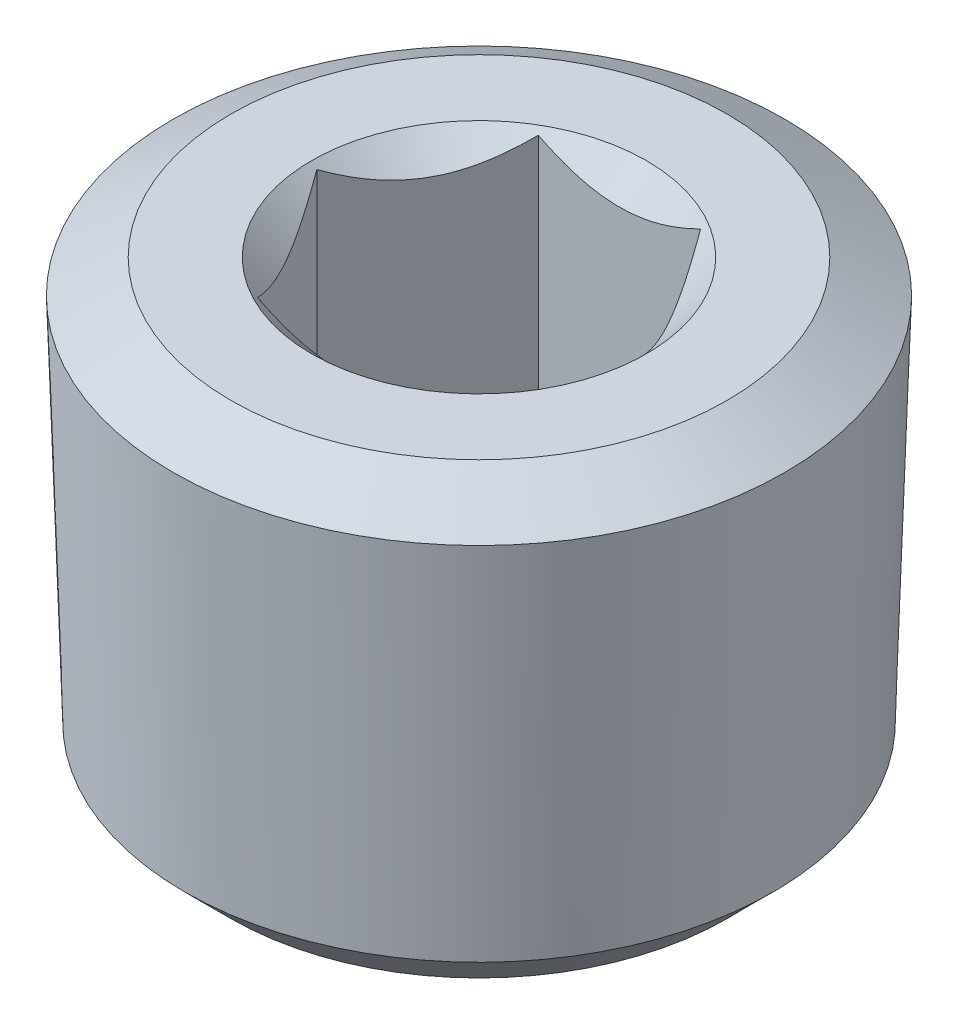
from build123d import *

# Parameters (mm, degrees)
CUT_EXTRUDE1_START = -6.858
CUT_EXTRUDE1_DEPTH = 6.71095


with BuildPart() as part:
    # Sketch2 → Revolve1 (revolve)
    with BuildSketch(Plane.XY, mode=Mode.PRIVATE) as revolve1_sk:
        Polygon((0, 0), (-7.020348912, 0), (-8.657297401, -0.94509265), (-8.331271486, -11.389077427), (-7.020348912, -12.7), (0, -12.7), align=None)
    revolve(revolve1_sk.sketch.rotate(Axis((0, 10.744282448, 0), (0, -1, 0)), 270), axis=Axis((0, 10.744282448, 0), (0, -1, 0)))

    # Sketch3 → Cut-Revolve1 (revolve, cut)
    with BuildSketch(Plane.XY, mode=Mode.PRIVATE) as cut_revolve1_sk:
        Polygon((0, 0), (-4.7371, 0), (-3.9751, -0.762), (-3.9751, -6.858), (-2.706919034, -7.62), (0, -7.62), align=None)
    revolve(cut_revolve1_sk.sketch.rotate(Axis((0, 2.934222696, 0), (0, -1, 0)), 270), axis=Axis((0, 2.934222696, 0), (0, -1, 0)), mode=Mode.SUBTRACT)

    # Sketch4 → Cut-Extrude1 (cut)
    with BuildSketch(Plane(origin=(0, 0, 0), x_dir=(1, 0, 0), z_dir=(0, 1, 0)).offset(CUT_EXTRUDE1_START)):
        Polygon((-2.295025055, -3.9751), (2.295025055, -3.9751), (4.59005011, 0), (2.295025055, 3.9751), (-2.295025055, 3.9751), (-4.59005011, 0), align=None)
    extrude(amount=CUT_EXTRUDE1_DEPTH, mode=Mode.SUBTRACT)


solid = part.part
